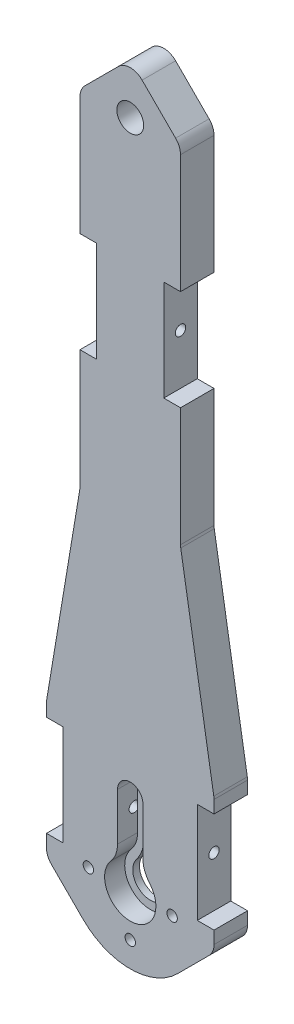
from build123d import *

# Parameters (mm, degrees)
CROQUIS1_R              = 4
SALIENTE_EXTRUIR1_DEPTH = 10
CROQUIS2_R              = 1.55
SALIENTE_EXTRUIR2_DEPTH = 4
CROQUIS3_R              = 15
CROQUIS3_R_2            = 5.25
CORTAR_EXTRUIR1_DEPTH   = 2
CROQUIS4_R              = 1.55
CORTAR_EXTRUIR2_DEPTH   = 217.596398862
REDONDEO2_R             = 5
CORTAR_EXTRUIR4_DEPTH   = 5
CORTAR_EXTRUIR5_DEPTH   = 5
CROQUIS8_W              = 10
CROQUIS8_H              = 30
CORTAR_EXTRUIR6_DEPTH   = 5
CROQUIS10_R             = 1.55
CORTAR_EXTRUIR8_DEPTH   = 16.2
CORTAR_EXTRUIR10_DEPTH  = 6
CROQUIS9_R              = 1.55
CORTAR_EXTRUIR11_DEPTH  = 217.017893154
CROQUIS13_W             = 10
CROQUIS13_H             = 30
CORTAR_EXTRUIR12_DEPTH  = 5
CORTAR_EXTRUIR13_START  = -16.2
CROQUIS15_R             = 1.55
CORTAR_EXTRUIR13_DEPTH  = 16.2
CROQUIS16_R             = 15
CROQUIS16_R_2           = 1.55
SALIENTE_EXTRUIR3_DEPTH = 0.5


with BuildPart() as part:
    # Croquis1 → Saliente-Extruir1 (new body)
    with BuildSketch(Plane.XY):
        with BuildLine():
            Line((-25, -3.284271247), (-14.142135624, -14.142135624))
            ThreePointArc((-14.142135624, -14.142135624), (0, -20), (14.142135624, -14.142135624))
            Line((14.142135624, -14.142135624), (25, -3.284271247))
            Line((25, -3.284271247), (25, 36.715728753))
            Line((25, 36.715728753), (15, 96.715728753))
            Line((15, 96.715728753), (15, 200))
            Line((15, 200), (0, 215))
            Line((0, 215), (-15, 200))
            Line((-15, 200), (-15, 96.715728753))
            Line((-15, 96.715728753), (-25, 36.715728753))
            Line((-25, 36.715728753), (-25, -3.284271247))
        make_face()
        with BuildLine():
            ThreePointArc((-5.8, 4.35), (-4.313167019, 7.18772234), (-3.8, 10.35))
            Line((-3.8, 10.35), (-3.8, 24.5))
            ThreePointArc((-3.8, 24.5), (-2.687005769, 27.187005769), (0, 28.3))
            ThreePointArc((0, 28.3), (2.687005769, 27.187005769), (3.8, 24.5))
            Line((3.8, 24.5), (3.8, 10.35))
            ThreePointArc((3.8, 10.35), (4.313167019, 7.18772234), (5.8, 4.35))
            ThreePointArc((5.8, 4.35), (6.484597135, -3.242298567), (0, -7.25))
            ThreePointArc((0, -7.25), (-6.484597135, -3.242298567), (-5.8, 4.35))
        make_face(mode=Mode.SUBTRACT)
        with Locations((0, 200)):
            Circle(CROQUIS1_R, mode=Mode.SUBTRACT)
    extrude(amount=SALIENTE_EXTRUIR1_DEPTH)

    # Croquis2 → Saliente-Extruir2 (add)
    with BuildSketch(Plane.XY):
        with BuildLine():
            Line((3.8, 10.35), (3.8, 24.5))
            ThreePointArc((3.8, 24.5), (0, 28.3), (-3.8, 24.5))
            Line((-3.8, 24.5), (-3.8, 10.35))
            ThreePointArc((-3.8, 10.35), (-4.313167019, 7.18772234), (-5.8, 4.35))
            ThreePointArc((-5.8, 4.35), (0, -7.25), (5.8, 4.35))
            ThreePointArc((5.8, 4.35), (4.313167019, 7.18772234), (3.8, 10.35))
        make_face()
        with Locations((0, 24.5)):
            Circle(CROQUIS2_R, mode=Mode.SUBTRACT)
        with Locations((0, 20.5)):
            Circle(CROQUIS2_R, mode=Mode.SUBTRACT)
        with BuildLine():
            ThreePointArc((1.8, 10.35), (0, 12.15), (-1.8, 10.35))
            ThreePointArc((-1.8, 10.35), (-2.415800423, 6.555266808), (-4.2, 3.15))
            ThreePointArc((-4.2, 3.15), (0, -5.25), (4.2, 3.15))
            ThreePointArc((4.2, 3.15), (2.415800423, 6.555266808), (1.8, 10.35))
        make_face(mode=Mode.SUBTRACT)
    extrude(amount=SALIENTE_EXTRUIR2_DEPTH)

    # Croquis3 → Cortar-Extruir1 (cut)
    with BuildSketch(Plane(origin=(0, 0, 0), x_dir=(-1, 0, 0), z_dir=(0, 0, -1))):
        Circle(CROQUIS3_R)
        Circle(CROQUIS3_R_2, mode=Mode.SUBTRACT)
    extrude(amount=-CORTAR_EXTRUIR1_DEPTH, mode=Mode.SUBTRACT)

    # Croquis4 → Cortar-Extruir2 (cut, through all)
    with BuildSketch(Plane(origin=(0, 0, 2), x_dir=(-1, 0, 0), z_dir=(0, 0, -1))):
        with Locations((-12.5, 0)):
            Circle(CROQUIS4_R)
        with Locations((0, -12.5)):
            Circle(CROQUIS4_R)
        with Locations((12.5, 0)):
            Circle(CROQUIS4_R)
    extrude(amount=-CORTAR_EXTRUIR2_DEPTH, mode=Mode.SUBTRACT)

    # Redondeo2
    redondeo2_edges = [part.edges().sort_by_distance(p)[0] for p in [
        (-25, 36.715728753, 5),
        (-15, 96.715728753, 5),
        (-15, 200, 5),
        (0, 215, 5),
        (15, 200, 5),
        (15, 96.715728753, 5),
        (25, 36.715728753, 5),
        (25, -3.284271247, 5),
        (-25, -3.284271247, 5),
    ]]
    fillet(redondeo2_edges, radius=REDONDEO2_R)

    # Croquis6 → Cortar-Extruir4 (cut)
    with BuildSketch(Plane.ZY.offset(25)):
        Polygon((10, 12.544356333), (10, 22.544356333), (10, 32.544356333), (0, 32.544356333), (0, 2.544356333), (10, 2.544356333), align=None)
    extrude(amount=-CORTAR_EXTRUIR4_DEPTH, mode=Mode.SUBTRACT)

    # Croquis7 → Cortar-Extruir5 (cut)
    with BuildSketch(Plane.ZY.offset(15)):
        Polygon((10, 142.529236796), (10, 152.529236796), (10, 162.529236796), (0, 162.529236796), (0, 132.529236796), (10, 132.529236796), align=None)
    extrude(amount=-CORTAR_EXTRUIR5_DEPTH, mode=Mode.SUBTRACT)

    # Croquis8 → Cortar-Extruir6 (cut)
    with BuildSketch(Plane(origin=(15, 0, 0), x_dir=(0, 0, -1), z_dir=(1, 0, 0))):
        with Locations((-5, 147.529236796)):
            Rectangle(CROQUIS8_W, CROQUIS8_H)
    extrude(amount=-CORTAR_EXTRUIR6_DEPTH, mode=Mode.SUBTRACT)

    # Croquis10 → Cortar-Extruir8 (cut)
    with BuildSketch(Plane.ZY.offset(20)):
        with Locations((5, 17.544356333)):
            Circle(CROQUIS10_R)
    extrude(amount=-CORTAR_EXTRUIR8_DEPTH, mode=Mode.SUBTRACT)

    # Croquis12 → Cortar-Extruir10 (cut)
    with BuildSketch(Plane.XY.offset(10)):
        with BuildLine():
            Line((-3.8, 10.35), (3.8, 10.35))
            ThreePointArc((3.8, 10.35), (4.313683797, 7.495669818), (5.790274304, 4.999522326))
            ThreePointArc((5.790274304, 4.999522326), (0, -7.65), (-5.790274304, 4.999522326))
            ThreePointArc((-5.790274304, 4.999522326), (-4.313683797, 7.495669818), (-3.8, 10.35))
        make_face()
    extrude(amount=-CORTAR_EXTRUIR10_DEPTH, mode=Mode.SUBTRACT)

    # Croquis9 → Cortar-Extruir11 (cut, through all)
    with BuildSketch(Plane.ZY.offset(10)):
        with Locations(Location((5, 147.529236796, 0), (0, 0, 270))):
            Circle(CROQUIS9_R)
    extrude(amount=-CORTAR_EXTRUIR11_DEPTH, mode=Mode.SUBTRACT)

    # Croquis13 → Cortar-Extruir12 (cut)
    with BuildSketch(Plane(origin=(25, 0, 0), x_dir=(0, 0, -1), z_dir=(1, 0, 0))):
        with Locations((-5, 17.544356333)):
            Rectangle(CROQUIS13_W, CROQUIS13_H)
    extrude(amount=-CORTAR_EXTRUIR12_DEPTH, mode=Mode.SUBTRACT)

    # Croquis15 → Cortar-Extruir13 (cut)
    with BuildSketch(Plane(origin=(20, 0, 0), x_dir=(0, 0, -1), z_dir=(1, 0, 0)).offset(CORTAR_EXTRUIR13_START)):
        with Locations(Location((-5, 17.544356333, 0), (0, 0, 180))):
            Circle(CROQUIS15_R)
    extrude(amount=CORTAR_EXTRUIR13_DEPTH, mode=Mode.SUBTRACT)

    # Croquis16 → Saliente-Extruir3 (add)
    with BuildSketch(Plane(origin=(0, 0, 2), x_dir=(-1, 0, 0), z_dir=(0, 0, -1))):
        Circle(CROQUIS16_R)
        with Locations((12.5, 0)):
            Circle(CROQUIS16_R_2, mode=Mode.SUBTRACT)
        with Locations((0, -12.5)):
            Circle(CROQUIS16_R_2, mode=Mode.SUBTRACT)
        with Locations((-12.5, 0)):
            Circle(CROQUIS16_R_2, mode=Mode.SUBTRACT)
        with BuildLine():
            ThreePointArc((1.8, 10.35), (0, 12.15), (-1.8, 10.35))
            ThreePointArc((-1.8, 10.35), (-2.415800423, 6.555266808), (-4.2, 3.15))
            ThreePointArc((-4.2, 3.15), (0, -5.25), (4.2, 3.15))
            ThreePointArc((4.2, 3.15), (2.415800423, 6.555266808), (1.8, 10.35))
        make_face(mode=Mode.SUBTRACT)
    extrude(amount=-SALIENTE_EXTRUIR3_DEPTH)


solid = part.part
